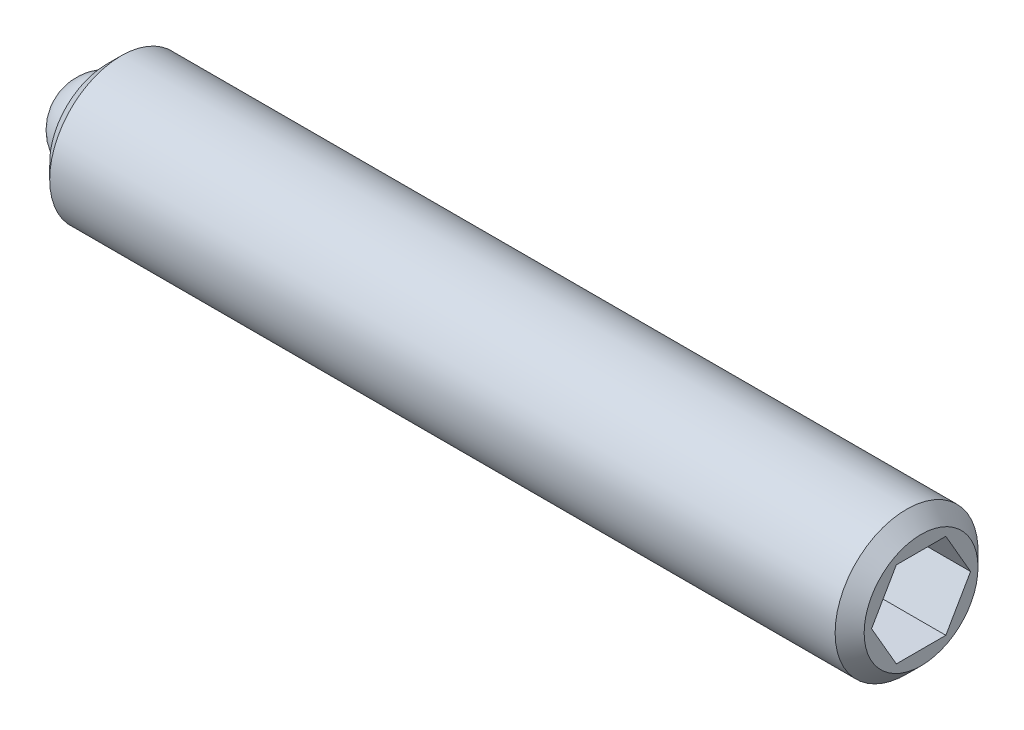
from build123d import *

# Parameters (mm, degrees)
SKETCH2_R           = 1.25
BOSS_EXTRUDE1_DEPTH = 14.25
CHAMFER1_SIZE       = 0.254
CHAMFER2_SIZE       = 0.254
CUT_EXTRUDE2_DEPTH  = 2
SKETCH3_R           = 0.75
CUT_EXTRUDE3_DEPTH  = 0.8


with BuildPart() as part:
    # Sketch2 → Boss-Extrude1 (new body)
    with BuildSketch(Plane(origin=(0, 0, 0), x_dir=(0, 0, -1), z_dir=(1, 0, 0))):
        with Locations(Location((0, 0, 0), (0, 0, 180))):
            Circle(SKETCH2_R)
    extrude(amount=BOSS_EXTRUDE1_DEPTH)

    # Chamfer1
    chamfer1_edges = [part.edges().sort_by_distance(p)[0] for p in [
        (0, 0, -1.25),
    ]]
    chamfer(chamfer1_edges, length=CHAMFER1_SIZE)

    # Chamfer2
    chamfer2_edges = [part.edges().sort_by_distance(p)[0] for p in [
        (14.25, 0, -1.25),
    ]]
    chamfer(chamfer2_edges, length=CHAMFER2_SIZE)

    # Sketch4 → Cut-Extrude2 (cut)
    with BuildSketch(Plane(origin=(14.25, 0, 0), x_dir=(0, 0, -1), z_dir=(1, 0, 0))):
        Polygon((0.866025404, 0), (0.433012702, 0.75), (-0.433012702, 0.75), (-0.866025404, 0), (-0.433012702, -0.75), (0.433012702, -0.75), align=None)
    extrude(amount=-CUT_EXTRUDE2_DEPTH, mode=Mode.SUBTRACT)

    # Sketch3 → Cut-Extrude3 (cut)
    with BuildSketch(Plane.ZY):
        Circle(SKETCH3_R)
    extrude(amount=-CUT_EXTRUDE3_DEPTH, mode=Mode.SUBTRACT)


with BuildPart() as body_2:
    # Sketch5 → Revolve1 (revolve)
    with BuildSketch(Plane.ZY):
        with BuildLine():
            Line((0, 0), (0, -0.75))
            ThreePointArc((0, -0.75), (-0.75, 0), (0, 0.75))
            Line((0, 0.75), (0, 0))
        make_face()
    revolve(axis=Axis((0, 0, 0), (0, 1, 0)))


solid = Compound([part.part, body_2.part])
